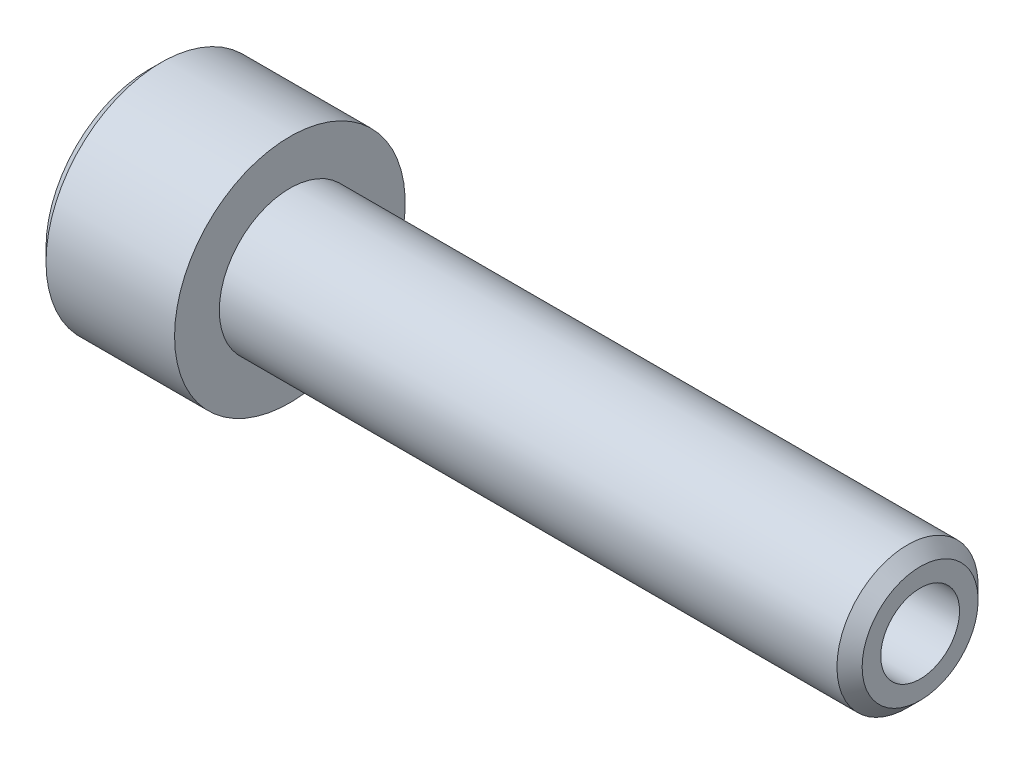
from build123d import *

# Parameters (mm, degrees)
CUT_EXTRUDE1_DEPTH             = 1.7859375
F_1_16_0_0625_DIAMETER_HOLE1_D = 1.5875


with BuildPart() as part:
    # Sketch1 → Base-Revolve (revolve)
    with BuildSketch(Plane.XY, mode=Mode.PRIVATE) as base_revolve_sk:
        Polygon((0, 1.4224), (12.446, 1.4224), (12.7, 1.1684), (12.7, 0), (-2.8448, 0), (-2.8448, 2.0701), (-2.5908, 2.3241), (0, 2.3241), align=None)
    revolve(base_revolve_sk.sketch.rotate(Axis((-52.8448, 0, 0), (1, 0, 0)), 90), axis=Axis((-52.8448, 0, 0), (1, 0, 0)))

    # Sketch3 → Cut-Extrude1 (cut)
    with BuildSketch(Plane.ZY.offset(2.8448)):
        Polygon((-0.687407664, 1.190625), (0.687407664, 1.190625), (1.374815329, 0), (0.687407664, -1.190625), (-0.687407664, -1.190625), (-1.374815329, 0), align=None)
    extrude(amount=-CUT_EXTRUDE1_DEPTH, mode=Mode.SUBTRACT)

    # 1_16 _0.0625_ Diameter Hole1 (through all)
    with Locations(Plane(origin=(12.7, 0, 0), x_dir=(0, 0, -1), z_dir=(1, 0, 0))):
        with Locations((0, 0)):
            Hole(F_1_16_0_0625_DIAMETER_HOLE1_D / 2)


solid = part.part
